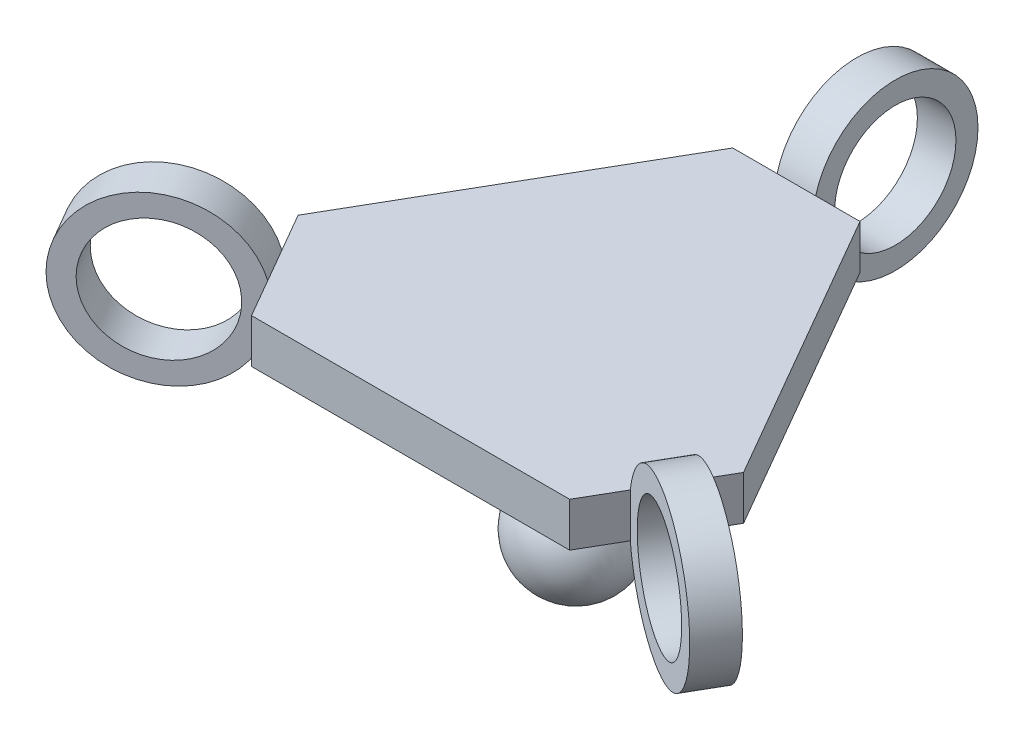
ISO-10303-21;
HEADER;
FILE_DESCRIPTION(('STEP AP214'),'2;1');
FILE_NAME('part.step','',(''),(''),'','','');
FILE_SCHEMA(('AUTOMOTIVE_DESIGN { 1 0 10303 214 1 1 1 1 }'));
ENDSEC;
DATA;
#1=APPLICATION_CONTEXT('core data for automotive mechanical design processes');
#2=APPLICATION_PROTOCOL_DEFINITION('international standard','automotive_design',2000,#1);
#3=PRODUCT_CONTEXT('',#1,'mechanical');
#4=PRODUCT('Part','Part','',(#3));
#5=PRODUCT_RELATED_PRODUCT_CATEGORY('part','',(#4));
#6=PRODUCT_DEFINITION_FORMATION('','',#4);
#7=PRODUCT_DEFINITION_CONTEXT('part definition',#1,'design');
#8=PRODUCT_DEFINITION('design','',#6,#7);
#9=PRODUCT_DEFINITION_SHAPE('','',#8);
#10=(LENGTH_UNIT() NAMED_UNIT(*) SI_UNIT(.MILLI.,.METRE.));
#11=(NAMED_UNIT(*) PLANE_ANGLE_UNIT() SI_UNIT($,.RADIAN.));
#12=(NAMED_UNIT(*) SI_UNIT($,.STERADIAN.) SOLID_ANGLE_UNIT());
#13=UNCERTAINTY_MEASURE_WITH_UNIT(LENGTH_MEASURE(1.E-05),#10,'distance_accuracy_value','');
#14=(GEOMETRIC_REPRESENTATION_CONTEXT(3) GLOBAL_UNCERTAINTY_ASSIGNED_CONTEXT((#13)) GLOBAL_UNIT_ASSIGNED_CONTEXT((#10,
#11,#12)) REPRESENTATION_CONTEXT('',''));
#15=CARTESIAN_POINT('',(0.,0.,0.));
#16=DIRECTION('',(0.,0.,1.));
#17=DIRECTION('',(1.,0.,0.));
#18=AXIS2_PLACEMENT_3D('',#15,#16,#17);
#19=CARTESIAN_POINT('',(0.,-26.,0.));
#20=DIRECTION('',(0.,0.,1.));
#21=DIRECTION('',(1.,0.,0.));
#22=AXIS2_PLACEMENT_3D('',#19,#20,#21);
#23=SPHERICAL_SURFACE('',#22,10.);
#24=CARTESIAN_POINT('',(0.,-26.,10.));
#25=VERTEX_POINT('',#24);
#26=VERTEX_LOOP('',#25);
#27=FACE_BOUND('',#26,.T.);
#28=ADVANCED_FACE('F44',(#27),#23,.T.);
#29=CLOSED_SHELL('',(#28));
#30=MANIFOLD_SOLID_BREP('B2',#29);
#31=CARTESIAN_POINT('',(0.,8.,0.));
#32=DIRECTION('',(0.,1.,0.));
#33=DIRECTION('',(0.,0.,1.));
#34=AXIS2_PLACEMENT_3D('',#31,#32,#33);
#35=PLANE('',#34);
#36=DIRECTION('',(-0.499999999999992,0.,0.866025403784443));
#37=VECTOR('',#36,1.);
#38=CARTESIAN_POINT('',(36.3877184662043,8.,16.9670071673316));
#39=LINE('',#38,#37);
#40=CARTESIAN_POINT('',(36.3877184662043,8.,16.9670071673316));
#41=VERTEX_POINT('',#40);
#42=CARTESIAN_POINT('',(32.8877184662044,8.,23.0291849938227));
#43=VERTEX_POINT('',#42);
#44=EDGE_CURVE('E76',#41,#43,#39,.T.);
#45=ORIENTED_EDGE('',*,*,#44,.F.);
#46=DIRECTION('',(0.866025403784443,0.,0.499999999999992));
#47=VECTOR('',#46,1.);
#48=CARTESIAN_POINT('',(1.74999999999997,8.,-3.03108891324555));
#49=LINE('',#48,#47);
#50=CARTESIAN_POINT('',(36.3910161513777,8.,16.9689110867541));
#51=VERTEX_POINT('',#50);
#52=EDGE_CURVE('E186',#41,#51,#49,.T.);
#53=ORIENTED_EDGE('',*,*,#52,.T.);
#54=DIRECTION('',(0.5,0.,-0.866025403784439));
#55=VECTOR('',#54,1.);
#56=CARTESIAN_POINT('',(28.8675134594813,8.,30.));
#57=LINE('',#56,#55);
#58=CARTESIAN_POINT('',(40.4145188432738,8.,9.99999999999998));
#59=VERTEX_POINT('',#58);
#60=EDGE_CURVE('E182',#51,#59,#57,.T.);
#61=ORIENTED_EDGE('',*,*,#60,.T.);
#62=DIRECTION('',(-0.5,0.,-0.866025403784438));
#63=VECTOR('',#62,1.);
#64=CARTESIAN_POINT('',(40.4145188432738,8.,9.99999999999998));
#65=LINE('',#64,#63);
#66=CARTESIAN_POINT('',(11.5470053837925,8.,-40.));
#67=VERTEX_POINT('',#66);
#68=EDGE_CURVE('E294',#59,#67,#65,.T.);
#69=ORIENTED_EDGE('',*,*,#68,.T.);
#70=DIRECTION('',(-1.,0.,0.));
#71=VECTOR('',#70,1.);
#72=CARTESIAN_POINT('',(11.5470053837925,8.,-40.));
#73=LINE('',#72,#71);
#74=CARTESIAN_POINT('',(3.5,8.,-40.));
#75=VERTEX_POINT('',#74);
#76=EDGE_CURVE('E299',#67,#75,#73,.T.);
#77=ORIENTED_EDGE('',*,*,#76,.T.);
#78=DIRECTION('',(0.,0.,-1.));
#79=VECTOR('',#78,1.);
#80=CARTESIAN_POINT('',(3.5,8.,0.));
#81=LINE('',#80,#79);
#82=CARTESIAN_POINT('',(3.5,8.,-39.9961921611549));
#83=VERTEX_POINT('',#82);
#84=EDGE_CURVE('E276',#83,#75,#81,.T.);
#85=ORIENTED_EDGE('',*,*,#84,.F.);
#86=DIRECTION('',(1.,0.,0.));
#87=VECTOR('',#86,1.);
#88=CARTESIAN_POINT('',(-3.5,8.,-39.9961921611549));
#89=LINE('',#88,#87);
#90=CARTESIAN_POINT('',(-3.5,8.,-39.9961921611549));
#91=VERTEX_POINT('',#90);
#92=EDGE_CURVE('E290',#91,#83,#89,.T.);
#93=ORIENTED_EDGE('',*,*,#92,.F.);
#94=DIRECTION('',(0.,0.,-1.));
#95=VECTOR('',#94,1.);
#96=CARTESIAN_POINT('',(-3.5,8.,0.));
#97=LINE('',#96,#95);
#98=CARTESIAN_POINT('',(-3.5,8.,-40.));
#99=VERTEX_POINT('',#98);
#100=EDGE_CURVE('E283',#91,#99,#97,.T.);
#101=ORIENTED_EDGE('',*,*,#100,.T.);
#102=CARTESIAN_POINT('',(-11.5470053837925,8.,-40.));
#103=VERTEX_POINT('',#102);
#104=EDGE_CURVE('E298',#99,#103,#73,.T.);
#105=ORIENTED_EDGE('',*,*,#104,.T.);
#106=DIRECTION('',(-0.5,0.,0.866025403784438));
#107=VECTOR('',#106,1.);
#108=CARTESIAN_POINT('',(-11.5470053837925,8.,-40.));
#109=LINE('',#108,#107);
#110=CARTESIAN_POINT('',(-40.4145188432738,8.,9.99999999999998));
#111=VERTEX_POINT('',#110);
#112=EDGE_CURVE('E303',#103,#111,#109,.T.);
#113=ORIENTED_EDGE('',*,*,#112,.T.);
#114=DIRECTION('',(0.5,0.,0.866025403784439));
#115=VECTOR('',#114,1.);
#116=CARTESIAN_POINT('',(-40.4145188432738,8.,9.99999999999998));
#117=LINE('',#116,#115);
#118=CARTESIAN_POINT('',(-36.3910161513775,8.,16.9689110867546));
#119=VERTEX_POINT('',#118);
#120=EDGE_CURVE('E307',#111,#119,#117,.T.);
#121=ORIENTED_EDGE('',*,*,#120,.T.);
#122=DIRECTION('',(-0.866025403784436,0.,0.500000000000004));
#123=VECTOR('',#122,1.);
#124=CARTESIAN_POINT('',(-1.75000000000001,8.,-3.03108891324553));
#125=LINE('',#124,#123);
#126=CARTESIAN_POINT('',(-36.3877184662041,8.,16.9670071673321));
#127=VERTEX_POINT('',#126);
#128=EDGE_CURVE('E230',#127,#119,#125,.T.);
#129=ORIENTED_EDGE('',*,*,#128,.F.);
#130=DIRECTION('',(-0.500000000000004,0.,-0.866025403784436));
#131=VECTOR('',#130,1.);
#132=CARTESIAN_POINT('',(-32.887718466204,8.,23.0291849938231));
#133=LINE('',#132,#131);
#134=CARTESIAN_POINT('',(-32.887718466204,8.,23.0291849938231));
#135=VERTEX_POINT('',#134);
#136=EDGE_CURVE('E244',#135,#127,#133,.T.);
#137=ORIENTED_EDGE('',*,*,#136,.F.);
#138=DIRECTION('',(-0.866025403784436,0.,0.500000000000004));
#139=VECTOR('',#138,1.);
#140=CARTESIAN_POINT('',(1.75000000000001,8.,3.03108891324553));
#141=LINE('',#140,#139);
#142=CARTESIAN_POINT('',(-32.8910161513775,8.,23.0310889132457));
#143=VERTEX_POINT('',#142);
#144=EDGE_CURVE('E237',#135,#143,#141,.T.);
#145=ORIENTED_EDGE('',*,*,#144,.T.);
#146=CARTESIAN_POINT('',(-28.8675134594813,8.,30.));
#147=VERTEX_POINT('',#146);
#148=EDGE_CURVE('E306',#143,#147,#117,.T.);
#149=ORIENTED_EDGE('',*,*,#148,.T.);
#150=DIRECTION('',(1.,0.,0.));
#151=VECTOR('',#150,1.);
#152=CARTESIAN_POINT('',(-28.8675134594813,8.,30.));
#153=LINE('',#152,#151);
#154=CARTESIAN_POINT('',(28.8675134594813,8.,30.));
#155=VERTEX_POINT('',#154);
#156=EDGE_CURVE('E311',#147,#155,#153,.T.);
#157=ORIENTED_EDGE('',*,*,#156,.T.);
#158=CARTESIAN_POINT('',(32.8910161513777,8.,23.0310889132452));
#159=VERTEX_POINT('',#158);
#160=EDGE_CURVE('E314',#155,#159,#57,.T.);
#161=ORIENTED_EDGE('',*,*,#160,.T.);
#162=DIRECTION('',(0.866025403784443,0.,0.499999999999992));
#163=VECTOR('',#162,1.);
#164=CARTESIAN_POINT('',(-1.74999999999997,8.,3.03108891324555));
#165=LINE('',#164,#163);
#166=EDGE_CURVE('E72',#43,#159,#165,.T.);
#167=ORIENTED_EDGE('',*,*,#166,.F.);
#168=EDGE_LOOP('',(#45,#53,#61,#69,#77,#85,#93,#101,#105,#113,#121,#129,#137,#145,#149,#157,
#161,#167));
#169=FACE_BOUND('',#168,.T.);
#170=ADVANCED_FACE('F56',(#169),#35,.T.);
#171=CARTESIAN_POINT('',(28.8675134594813,8.,30.));
#172=DIRECTION('',(-0.866025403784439,0.,-0.5));
#173=DIRECTION('',(-0.5,0.,0.866025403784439));
#174=AXIS2_PLACEMENT_3D('',#171,#172,#173);
#175=PLANE('',#174);
#176=DIRECTION('',(0.,1.,0.));
#177=VECTOR('',#176,1.);
#178=CARTESIAN_POINT('',(36.3910161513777,8.,16.9689110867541));
#179=LINE('',#178,#177);
#180=CARTESIAN_POINT('',(36.3910161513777,0.,16.9689110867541));
#181=VERTEX_POINT('',#180);
#182=EDGE_CURVE('E180',#181,#51,#179,.T.);
#183=ORIENTED_EDGE('',*,*,#182,.F.);
#184=DIRECTION('',(0.5,0.,-0.866025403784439));
#185=VECTOR('',#184,1.);
#186=CARTESIAN_POINT('',(28.8675134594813,0.,30.));
#187=LINE('',#186,#185);
#188=CARTESIAN_POINT('',(40.4145188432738,0.,9.99999999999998));
#189=VERTEX_POINT('',#188);
#190=EDGE_CURVE('E162',#181,#189,#187,.T.);
#191=ORIENTED_EDGE('',*,*,#190,.T.);
#192=DIRECTION('',(0.,-1.,0.));
#193=VECTOR('',#192,1.);
#194=CARTESIAN_POINT('',(40.4145188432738,8.,9.99999999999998));
#195=LINE('',#194,#193);
#196=EDGE_CURVE('E317',#59,#189,#195,.T.);
#197=ORIENTED_EDGE('',*,*,#196,.F.);
#198=ORIENTED_EDGE('',*,*,#60,.F.);
#199=EDGE_LOOP('',(#183,#191,#197,#198));
#200=FACE_BOUND('',#199,.T.);
#201=ADVANCED_FACE('F181',(#200),#175,.F.);
#202=CARTESIAN_POINT('',(-40.4145188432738,8.,9.99999999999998));
#203=DIRECTION('',(0.866025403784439,0.,-0.5));
#204=DIRECTION('',(-0.5,0.,-0.866025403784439));
#205=AXIS2_PLACEMENT_3D('',#202,#203,#204);
#206=PLANE('',#205);
#207=DIRECTION('',(0.,1.,0.));
#208=VECTOR('',#207,1.);
#209=CARTESIAN_POINT('',(-32.8910161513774,8.,23.0310889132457));
#210=LINE('',#209,#208);
#211=CARTESIAN_POINT('',(-32.8910161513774,0.,23.0310889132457));
#212=VERTEX_POINT('',#211);
#213=EDGE_CURVE('E240',#212,#143,#210,.T.);
#214=ORIENTED_EDGE('',*,*,#213,.F.);
#215=DIRECTION('',(0.5,0.,0.866025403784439));
#216=VECTOR('',#215,1.);
#217=CARTESIAN_POINT('',(-40.4145188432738,0.,9.99999999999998));
#218=LINE('',#217,#216);
#219=CARTESIAN_POINT('',(-28.8675134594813,0.,30.));
#220=VERTEX_POINT('',#219);
#221=EDGE_CURVE('E329',#212,#220,#218,.T.);
#222=ORIENTED_EDGE('',*,*,#221,.T.);
#223=DIRECTION('',(0.,-1.,0.));
#224=VECTOR('',#223,1.);
#225=CARTESIAN_POINT('',(-28.8675134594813,8.,30.));
#226=LINE('',#225,#224);
#227=EDGE_CURVE('E343',#147,#220,#226,.T.);
#228=ORIENTED_EDGE('',*,*,#227,.F.);
#229=ORIENTED_EDGE('',*,*,#148,.F.);
#230=EDGE_LOOP('',(#214,#222,#228,#229));
#231=FACE_BOUND('',#230,.T.);
#232=ADVANCED_FACE('F378',(#231),#206,.F.);
#233=CARTESIAN_POINT('',(11.5470053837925,8.,-40.));
#234=DIRECTION('',(0.,0.,1.));
#235=DIRECTION('',(1.,0.,0.));
#236=AXIS2_PLACEMENT_3D('',#233,#234,#235);
#237=PLANE('',#236);
#238=DIRECTION('',(0.,1.,0.));
#239=VECTOR('',#238,1.);
#240=CARTESIAN_POINT('',(-3.5,8.,-40.));
#241=LINE('',#240,#239);
#242=CARTESIAN_POINT('',(-3.5,0.,-40.));
#243=VERTEX_POINT('',#242);
#244=EDGE_CURVE('E286',#243,#99,#241,.T.);
#245=ORIENTED_EDGE('',*,*,#244,.F.);
#246=DIRECTION('',(-1.,0.,0.));
#247=VECTOR('',#246,1.);
#248=CARTESIAN_POINT('',(11.5470053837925,0.,-40.));
#249=LINE('',#248,#247);
#250=CARTESIAN_POINT('',(-11.5470053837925,0.,-40.));
#251=VERTEX_POINT('',#250);
#252=EDGE_CURVE('E320',#243,#251,#249,.T.);
#253=ORIENTED_EDGE('',*,*,#252,.T.);
#254=DIRECTION('',(0.,-1.,0.));
#255=VECTOR('',#254,1.);
#256=CARTESIAN_POINT('',(-11.5470053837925,8.,-40.));
#257=LINE('',#256,#255);
#258=EDGE_CURVE('E65',#103,#251,#257,.T.);
#259=ORIENTED_EDGE('',*,*,#258,.F.);
#260=ORIENTED_EDGE('',*,*,#104,.F.);
#261=EDGE_LOOP('',(#245,#253,#259,#260));
#262=FACE_BOUND('',#261,.T.);
#263=ADVANCED_FACE('F387',(#262),#237,.F.);
#264=CARTESIAN_POINT('',(40.4145188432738,8.,9.99999999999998));
#265=DIRECTION('',(-0.866025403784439,0.,0.5));
#266=DIRECTION('',(0.5,0.,0.866025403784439));
#267=AXIS2_PLACEMENT_3D('',#264,#265,#266);
#268=PLANE('',#267);
#269=DIRECTION('',(-0.5,0.,-0.866025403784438));
#270=VECTOR('',#269,1.);
#271=CARTESIAN_POINT('',(40.4145188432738,0.,9.99999999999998));
#272=LINE('',#271,#270);
#273=CARTESIAN_POINT('',(11.5470053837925,0.,-40.));
#274=VERTEX_POINT('',#273);
#275=EDGE_CURVE('E170',#189,#274,#272,.T.);
#276=ORIENTED_EDGE('',*,*,#275,.T.);
#277=DIRECTION('',(0.,-1.,0.));
#278=VECTOR('',#277,1.);
#279=CARTESIAN_POINT('',(11.5470053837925,8.,-40.));
#280=LINE('',#279,#278);
#281=EDGE_CURVE('E42',#67,#274,#280,.T.);
#282=ORIENTED_EDGE('',*,*,#281,.F.);
#283=ORIENTED_EDGE('',*,*,#68,.F.);
#284=ORIENTED_EDGE('',*,*,#196,.T.);
#285=EDGE_LOOP('',(#276,#282,#283,#284));
#286=FACE_BOUND('',#285,.T.);
#287=ADVANCED_FACE('F58',(#286),#268,.F.);
#288=CARTESIAN_POINT('',(3.5,0.,-40.));
#289=VERTEX_POINT('',#288);
#290=EDGE_CURVE('E321',#274,#289,#249,.T.);
#291=ORIENTED_EDGE('',*,*,#290,.T.);
#292=DIRECTION('',(0.,1.,0.));
#293=VECTOR('',#292,1.);
#294=CARTESIAN_POINT('',(3.5,8.,-40.));
#295=LINE('',#294,#293);
#296=EDGE_CURVE('E280',#289,#75,#295,.T.);
#297=ORIENTED_EDGE('',*,*,#296,.T.);
#298=ORIENTED_EDGE('',*,*,#76,.F.);
#299=ORIENTED_EDGE('',*,*,#281,.T.);
#300=EDGE_LOOP('',(#291,#297,#298,#299));
#301=FACE_BOUND('',#300,.T.);
#302=ADVANCED_FACE('F399',(#301),#237,.F.);
#303=CARTESIAN_POINT('',(-11.5470053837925,8.,-40.));
#304=DIRECTION('',(0.866025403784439,0.,0.5));
#305=DIRECTION('',(0.5,0.,-0.866025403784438));
#306=AXIS2_PLACEMENT_3D('',#303,#304,#305);
#307=PLANE('',#306);
#308=DIRECTION('',(-0.5,0.,0.866025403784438));
#309=VECTOR('',#308,1.);
#310=CARTESIAN_POINT('',(-11.5470053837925,0.,-40.));
#311=LINE('',#310,#309);
#312=CARTESIAN_POINT('',(-40.4145188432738,0.,9.99999999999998));
#313=VERTEX_POINT('',#312);
#314=EDGE_CURVE('E325',#251,#313,#311,.T.);
#315=ORIENTED_EDGE('',*,*,#314,.T.);
#316=DIRECTION('',(0.,-1.,0.));
#317=VECTOR('',#316,1.);
#318=CARTESIAN_POINT('',(-40.4145188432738,8.,9.99999999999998));
#319=LINE('',#318,#317);
#320=EDGE_CURVE('E347',#111,#313,#319,.T.);
#321=ORIENTED_EDGE('',*,*,#320,.F.);
#322=ORIENTED_EDGE('',*,*,#112,.F.);
#323=ORIENTED_EDGE('',*,*,#258,.T.);
#324=EDGE_LOOP('',(#315,#321,#322,#323));
#325=FACE_BOUND('',#324,.T.);
#326=ADVANCED_FACE('F356',(#325),#307,.F.);
#327=CARTESIAN_POINT('',(-36.3910161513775,0.,16.9689110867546));
#328=VERTEX_POINT('',#327);
#329=EDGE_CURVE('E330',#313,#328,#218,.T.);
#330=ORIENTED_EDGE('',*,*,#329,.T.);
#331=DIRECTION('',(0.,1.,0.));
#332=VECTOR('',#331,1.);
#333=CARTESIAN_POINT('',(-36.3910161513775,8.,16.9689110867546));
#334=LINE('',#333,#332);
#335=EDGE_CURVE('E234',#328,#119,#334,.T.);
#336=ORIENTED_EDGE('',*,*,#335,.T.);
#337=ORIENTED_EDGE('',*,*,#120,.F.);
#338=ORIENTED_EDGE('',*,*,#320,.T.);
#339=EDGE_LOOP('',(#330,#336,#337,#338));
#340=FACE_BOUND('',#339,.T.);
#341=ADVANCED_FACE('F364',(#340),#206,.F.);
#342=CARTESIAN_POINT('',(-28.8675134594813,8.,30.));
#343=DIRECTION('',(0.,0.,-1.));
#344=DIRECTION('',(-1.,0.,0.));
#345=AXIS2_PLACEMENT_3D('',#342,#343,#344);
#346=PLANE('',#345);
#347=DIRECTION('',(1.,0.,0.));
#348=VECTOR('',#347,1.);
#349=CARTESIAN_POINT('',(-28.8675134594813,0.,30.));
#350=LINE('',#349,#348);
#351=CARTESIAN_POINT('',(28.8675134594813,0.,30.));
#352=VERTEX_POINT('',#351);
#353=EDGE_CURVE('E176',#220,#352,#350,.T.);
#354=ORIENTED_EDGE('',*,*,#353,.T.);
#355=DIRECTION('',(0.,-1.,0.));
#356=VECTOR('',#355,1.);
#357=CARTESIAN_POINT('',(28.8675134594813,8.,30.));
#358=LINE('',#357,#356);
#359=EDGE_CURVE('E339',#155,#352,#358,.T.);
#360=ORIENTED_EDGE('',*,*,#359,.F.);
#361=ORIENTED_EDGE('',*,*,#156,.F.);
#362=ORIENTED_EDGE('',*,*,#227,.T.);
#363=EDGE_LOOP('',(#354,#360,#361,#362));
#364=FACE_BOUND('',#363,.T.);
#365=ADVANCED_FACE('F422',(#364),#346,.F.);
#366=CARTESIAN_POINT('',(32.8910161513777,0.,23.0310889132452));
#367=VERTEX_POINT('',#366);
#368=EDGE_CURVE('E175',#352,#367,#187,.T.);
#369=ORIENTED_EDGE('',*,*,#368,.T.);
#370=DIRECTION('',(0.,1.,0.));
#371=VECTOR('',#370,1.);
#372=CARTESIAN_POINT('',(32.8910161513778,8.,23.0310889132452));
#373=LINE('',#372,#371);
#374=EDGE_CURVE('E203',#367,#159,#373,.T.);
#375=ORIENTED_EDGE('',*,*,#374,.T.);
#376=ORIENTED_EDGE('',*,*,#160,.F.);
#377=ORIENTED_EDGE('',*,*,#359,.T.);
#378=EDGE_LOOP('',(#369,#375,#376,#377));
#379=FACE_BOUND('',#378,.T.);
#380=ADVANCED_FACE('F414',(#379),#175,.F.);
#381=CARTESIAN_POINT('',(0.,0.,0.));
#382=DIRECTION('',(0.,1.,0.));
#383=DIRECTION('',(0.,0.,1.));
#384=AXIS2_PLACEMENT_3D('',#381,#382,#383);
#385=PLANE('',#384);
#386=CARTESIAN_POINT('',(0.,0.,0.));
#387=DIRECTION('',(0.,1.,0.));
#388=DIRECTION('',(0.,0.,1.));
#389=AXIS2_PLACEMENT_3D('',#386,#387,#388);
#390=CIRCLE('',#389,5.);
#391=CARTESIAN_POINT('',(0.,0.,5.));
#392=VERTEX_POINT('',#391);
#393=EDGE_CURVE('E256',#392,#392,#390,.T.);
#394=ORIENTED_EDGE('',*,*,#393,.T.);
#395=EDGE_LOOP('',(#394));
#396=FACE_BOUND('',#395,.T.);
#397=ORIENTED_EDGE('',*,*,#275,.F.);
#398=ORIENTED_EDGE('',*,*,#190,.F.);
#399=DIRECTION('',(0.499999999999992,0.,-0.866025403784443));
#400=VECTOR('',#399,1.);
#401=CARTESIAN_POINT('',(28.8675134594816,0.,29.9999999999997));
#402=LINE('',#401,#400);
#403=EDGE_CURVE('E167',#367,#181,#402,.T.);
#404=ORIENTED_EDGE('',*,*,#403,.F.);
#405=ORIENTED_EDGE('',*,*,#368,.F.);
#406=ORIENTED_EDGE('',*,*,#353,.F.);
#407=ORIENTED_EDGE('',*,*,#221,.F.);
#408=DIRECTION('',(0.500000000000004,0.,0.866025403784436));
#409=VECTOR('',#408,1.);
#410=CARTESIAN_POINT('',(-40.4145188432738,0.,10.0000000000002));
#411=LINE('',#410,#409);
#412=EDGE_CURVE('E248',#328,#212,#411,.T.);
#413=ORIENTED_EDGE('',*,*,#412,.F.);
#414=ORIENTED_EDGE('',*,*,#329,.F.);
#415=ORIENTED_EDGE('',*,*,#314,.F.);
#416=ORIENTED_EDGE('',*,*,#252,.F.);
#417=EDGE_CURVE('E326',#289,#243,#249,.T.);
#418=ORIENTED_EDGE('',*,*,#417,.F.);
#419=ORIENTED_EDGE('',*,*,#290,.F.);
#420=EDGE_LOOP('',(#397,#398,#404,#405,#406,#407,#413,#414,#415,#416,#418,#419));
#421=FACE_BOUND('',#420,.T.);
#422=ADVANCED_FACE('F164',(#396,#421),#385,.F.);
#423=CARTESIAN_POINT('',(-3.5,4.00688116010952,-54.4549266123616));
#424=DIRECTION('',(1.,0.,0.));
#425=DIRECTION('',(0.,0.,-1.));
#426=AXIS2_PLACEMENT_3D('',#423,#424,#425);
#427=PLANE('',#426);
#428=CARTESIAN_POINT('',(-3.5,4.00688116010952,-54.4549266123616));
#429=DIRECTION('',(1.,0.,0.));
#430=DIRECTION('',(0.,0.,-1.));
#431=AXIS2_PLACEMENT_3D('',#428,#429,#430);
#432=CIRCLE('',#431,11.);
#433=CARTESIAN_POINT('',(-3.5,4.00688116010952,-65.4549266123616));
#434=VERTEX_POINT('',#433);
#435=EDGE_CURVE('E264',#434,#434,#432,.T.);
#436=ORIENTED_EDGE('',*,*,#435,.T.);
#437=EDGE_LOOP('',(#436));
#438=FACE_BOUND('',#437,.T.);
#439=CARTESIAN_POINT('',(-3.5,4.00688116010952,-54.4549266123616));
#440=DIRECTION('',(1.,0.,0.));
#441=DIRECTION('',(0.,0.,-1.));
#442=AXIS2_PLACEMENT_3D('',#439,#440,#441);
#443=CIRCLE('',#442,15.);
#444=EDGE_CURVE('E272',#243,#91,#443,.T.);
#445=ORIENTED_EDGE('',*,*,#444,.F.);
#446=ORIENTED_EDGE('',*,*,#244,.T.);
#447=ORIENTED_EDGE('',*,*,#100,.F.);
#448=EDGE_LOOP('',(#445,#446,#447));
#449=FACE_BOUND('',#448,.T.);
#450=ADVANCED_FACE('F394',(#438,#449),#427,.F.);
#451=CARTESIAN_POINT('',(3.5,4.00688116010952,-54.4549266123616));
#452=DIRECTION('',(1.,0.,0.));
#453=DIRECTION('',(0.,0.,-1.));
#454=AXIS2_PLACEMENT_3D('',#451,#452,#453);
#455=PLANE('',#454);
#456=CARTESIAN_POINT('',(3.5,4.00688116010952,-54.4549266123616));
#457=DIRECTION('',(1.,0.,0.));
#458=DIRECTION('',(0.,0.,-1.));
#459=AXIS2_PLACEMENT_3D('',#456,#457,#458);
#460=CIRCLE('',#459,11.);
#461=CARTESIAN_POINT('',(3.5,4.00688116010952,-65.4549266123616));
#462=VERTEX_POINT('',#461);
#463=EDGE_CURVE('E260',#462,#462,#460,.T.);
#464=ORIENTED_EDGE('',*,*,#463,.F.);
#465=EDGE_LOOP('',(#464));
#466=FACE_BOUND('',#465,.T.);
#467=ORIENTED_EDGE('',*,*,#296,.F.);
#468=CARTESIAN_POINT('',(3.5,4.00688116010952,-54.4549266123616));
#469=DIRECTION('',(1.,0.,0.));
#470=DIRECTION('',(0.,0.,-1.));
#471=AXIS2_PLACEMENT_3D('',#468,#469,#470);
#472=CIRCLE('',#471,15.);
#473=EDGE_CURVE('E268',#289,#83,#472,.T.);
#474=ORIENTED_EDGE('',*,*,#473,.T.);
#475=ORIENTED_EDGE('',*,*,#84,.T.);
#476=EDGE_LOOP('',(#467,#474,#475));
#477=FACE_BOUND('',#476,.T.);
#478=ADVANCED_FACE('F397',(#466,#477),#455,.T.);
#479=CARTESIAN_POINT('',(-3.5,4.00688116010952,-54.4549266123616));
#480=DIRECTION('',(1.,0.,0.));
#481=DIRECTION('',(0.,0.,-1.));
#482=AXIS2_PLACEMENT_3D('',#479,#480,#481);
#483=CYLINDRICAL_SURFACE('',#482,15.);
#484=ORIENTED_EDGE('',*,*,#444,.T.);
#485=ORIENTED_EDGE('',*,*,#92,.T.);
#486=ORIENTED_EDGE('',*,*,#473,.F.);
#487=ORIENTED_EDGE('',*,*,#417,.T.);
#488=EDGE_LOOP('',(#484,#485,#486,#487));
#489=FACE_BOUND('',#488,.T.);
#490=ADVANCED_FACE('F393',(#489),#483,.T.);
#491=CARTESIAN_POINT('',(-16.,4.00688116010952,-54.4549266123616));
#492=DIRECTION('',(1.,0.,0.));
#493=DIRECTION('',(0.,0.,-1.));
#494=AXIS2_PLACEMENT_3D('',#491,#492,#493);
#495=CYLINDRICAL_SURFACE('',#494,11.);
#496=ORIENTED_EDGE('',*,*,#463,.T.);
#497=EDGE_LOOP('',(#496));
#498=FACE_BOUND('',#497,.T.);
#499=ORIENTED_EDGE('',*,*,#435,.F.);
#500=EDGE_LOOP('',(#499));
#501=FACE_BOUND('',#500,.T.);
#502=ADVANCED_FACE('F473',(#498,#501),#495,.F.);
#503=CARTESIAN_POINT('',(0.,-26.,0.));
#504=DIRECTION('',(0.,1.,0.));
#505=DIRECTION('',(0.,0.,1.));
#506=AXIS2_PLACEMENT_3D('',#503,#504,#505);
#507=CYLINDRICAL_SURFACE('',#506,5.);
#508=CARTESIAN_POINT('',(0.,-26.,0.));
#509=DIRECTION('',(0.,1.,0.));
#510=DIRECTION('',(0.,0.,1.));
#511=AXIS2_PLACEMENT_3D('',#508,#509,#510);
#512=CIRCLE('',#511,5.);
#513=CARTESIAN_POINT('',(0.,-26.,5.));
#514=VERTEX_POINT('',#513);
#515=EDGE_CURVE('E252',#514,#514,#512,.T.);
#516=ORIENTED_EDGE('',*,*,#515,.T.);
#517=EDGE_LOOP('',(#516));
#518=FACE_BOUND('',#517,.T.);
#519=ORIENTED_EDGE('',*,*,#393,.F.);
#520=EDGE_LOOP('',(#519));
#521=FACE_BOUND('',#520,.T.);
#522=ADVANCED_FACE('F478',(#518,#521),#507,.T.);
#523=CARTESIAN_POINT('',(0.,-26.,0.));
#524=DIRECTION('',(0.,1.,0.));
#525=DIRECTION('',(0.,0.,1.));
#526=AXIS2_PLACEMENT_3D('',#523,#524,#525);
#527=PLANE('',#526);
#528=ORIENTED_EDGE('',*,*,#515,.F.);
#529=EDGE_LOOP('',(#528));
#530=FACE_BOUND('',#529,.T.);
#531=ADVANCED_FACE('F485',(#530),#527,.F.);
#532=CARTESIAN_POINT('',(-45.4093498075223,4.00688116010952,30.2585522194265));
#533=DIRECTION('',(-0.500000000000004,0.,-0.866025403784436));
#534=DIRECTION('',(-0.866025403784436,0.,0.500000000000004));
#535=AXIS2_PLACEMENT_3D('',#532,#533,#534);
#536=PLANE('',#535);
#537=CARTESIAN_POINT('',(-45.4093498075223,4.00688116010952,30.2585522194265));
#538=DIRECTION('',(-0.500000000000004,0.,-0.866025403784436));
#539=DIRECTION('',(-0.866025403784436,0.,0.500000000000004));
#540=AXIS2_PLACEMENT_3D('',#537,#538,#539);
#541=CIRCLE('',#540,11.);
#542=CARTESIAN_POINT('',(-54.9356292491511,4.00688116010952,35.7585522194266));
#543=VERTEX_POINT('',#542);
#544=EDGE_CURVE('E218',#543,#543,#541,.T.);
#545=ORIENTED_EDGE('',*,*,#544,.T.);
#546=EDGE_LOOP('',(#545));
#547=FACE_BOUND('',#546,.T.);
#548=CARTESIAN_POINT('',(-45.4093498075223,4.00688116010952,30.2585522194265));
#549=DIRECTION('',(-0.500000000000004,0.,-0.866025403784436));
#550=DIRECTION('',(-0.866025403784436,0.,0.500000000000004));
#551=AXIS2_PLACEMENT_3D('',#548,#549,#550);
#552=CIRCLE('',#551,15.);
#553=EDGE_CURVE('E226',#212,#135,#552,.T.);
#554=ORIENTED_EDGE('',*,*,#553,.F.);
#555=ORIENTED_EDGE('',*,*,#213,.T.);
#556=ORIENTED_EDGE('',*,*,#144,.F.);
#557=EDGE_LOOP('',(#554,#555,#556));
#558=FACE_BOUND('',#557,.T.);
#559=ADVANCED_FACE('F375',(#547,#558),#536,.F.);
#560=CARTESIAN_POINT('',(-48.9093498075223,4.00688116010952,24.1963743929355));
#561=DIRECTION('',(-0.500000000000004,0.,-0.866025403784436));
#562=DIRECTION('',(-0.866025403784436,0.,0.500000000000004));
#563=AXIS2_PLACEMENT_3D('',#560,#561,#562);
#564=PLANE('',#563);
#565=CARTESIAN_POINT('',(-48.9093498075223,4.00688116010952,24.1963743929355));
#566=DIRECTION('',(-0.500000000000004,0.,-0.866025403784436));
#567=DIRECTION('',(-0.866025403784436,0.,0.500000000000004));
#568=AXIS2_PLACEMENT_3D('',#565,#566,#567);
#569=CIRCLE('',#568,11.);
#570=CARTESIAN_POINT('',(-58.4356292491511,4.00688116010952,29.6963743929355));
#571=VERTEX_POINT('',#570);
#572=EDGE_CURVE('E196',#571,#571,#569,.T.);
#573=ORIENTED_EDGE('',*,*,#572,.F.);
#574=EDGE_LOOP('',(#573));
#575=FACE_BOUND('',#574,.T.);
#576=ORIENTED_EDGE('',*,*,#335,.F.);
#577=CARTESIAN_POINT('',(-48.9093498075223,4.00688116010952,24.1963743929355));
#578=DIRECTION('',(-0.500000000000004,0.,-0.866025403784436));
#579=DIRECTION('',(-0.866025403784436,0.,0.500000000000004));
#580=AXIS2_PLACEMENT_3D('',#577,#578,#579);
#581=CIRCLE('',#580,15.);
#582=EDGE_CURVE('E222',#328,#127,#581,.T.);
#583=ORIENTED_EDGE('',*,*,#582,.T.);
#584=ORIENTED_EDGE('',*,*,#128,.T.);
#585=EDGE_LOOP('',(#576,#583,#584));
#586=FACE_BOUND('',#585,.T.);
#587=ADVANCED_FACE('F368',(#575,#586),#564,.T.);
#588=CARTESIAN_POINT('',(-45.4093498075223,4.00688116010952,30.2585522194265));
#589=DIRECTION('',(-0.500000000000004,0.,-0.866025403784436));
#590=DIRECTION('',(-0.866025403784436,0.,0.500000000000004));
#591=AXIS2_PLACEMENT_3D('',#588,#589,#590);
#592=CYLINDRICAL_SURFACE('',#591,15.);
#593=ORIENTED_EDGE('',*,*,#553,.T.);
#594=ORIENTED_EDGE('',*,*,#136,.T.);
#595=ORIENTED_EDGE('',*,*,#582,.F.);
#596=ORIENTED_EDGE('',*,*,#412,.T.);
#597=EDGE_LOOP('',(#593,#594,#595,#596));
#598=FACE_BOUND('',#597,.T.);
#599=ADVANCED_FACE('F370',(#598),#592,.T.);
#600=CARTESIAN_POINT('',(-39.1593498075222,4.00688116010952,41.083869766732));
#601=DIRECTION('',(-0.500000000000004,0.,-0.866025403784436));
#602=DIRECTION('',(-0.866025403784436,0.,0.500000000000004));
#603=AXIS2_PLACEMENT_3D('',#600,#601,#602);
#604=CYLINDRICAL_SURFACE('',#603,11.);
#605=ORIENTED_EDGE('',*,*,#572,.T.);
#606=EDGE_LOOP('',(#605));
#607=FACE_BOUND('',#606,.T.);
#608=ORIENTED_EDGE('',*,*,#544,.F.);
#609=EDGE_LOOP('',(#608));
#610=FACE_BOUND('',#609,.T.);
#611=ADVANCED_FACE('F514',(#607,#610),#604,.F.);
#612=CARTESIAN_POINT('',(48.9093498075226,4.00688116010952,24.1963743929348));
#613=DIRECTION('',(-0.499999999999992,0.,0.866025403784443));
#614=DIRECTION('',(0.866025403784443,0.,0.499999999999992));
#615=AXIS2_PLACEMENT_3D('',#612,#613,#614);
#616=PLANE('',#615);
#617=CARTESIAN_POINT('',(48.9093498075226,4.00688116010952,24.1963743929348));
#618=DIRECTION('',(-0.499999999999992,0.,0.866025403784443));
#619=DIRECTION('',(0.866025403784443,0.,0.499999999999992));
#620=AXIS2_PLACEMENT_3D('',#617,#618,#619);
#621=CIRCLE('',#620,11.);
#622=CARTESIAN_POINT('',(58.4356292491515,4.00688116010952,29.6963743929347));
#623=VERTEX_POINT('',#622);
#624=EDGE_CURVE('E205',#623,#623,#621,.T.);
#625=ORIENTED_EDGE('',*,*,#624,.T.);
#626=EDGE_LOOP('',(#625));
#627=FACE_BOUND('',#626,.T.);
#628=CARTESIAN_POINT('',(48.9093498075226,4.00688116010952,24.1963743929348));
#629=DIRECTION('',(-0.499999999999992,0.,0.866025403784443));
#630=DIRECTION('',(0.866025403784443,0.,0.499999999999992));
#631=AXIS2_PLACEMENT_3D('',#628,#629,#630);
#632=CIRCLE('',#631,15.);
#633=EDGE_CURVE('E192',#181,#41,#632,.T.);
#634=ORIENTED_EDGE('',*,*,#633,.F.);
#635=ORIENTED_EDGE('',*,*,#182,.T.);
#636=ORIENTED_EDGE('',*,*,#52,.F.);
#637=EDGE_LOOP('',(#634,#635,#636));
#638=FACE_BOUND('',#637,.T.);
#639=ADVANCED_FACE('F198',(#627,#638),#616,.F.);
#640=CARTESIAN_POINT('',(45.4093498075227,4.00688116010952,30.2585522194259));
#641=DIRECTION('',(-0.499999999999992,0.,0.866025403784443));
#642=DIRECTION('',(0.866025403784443,0.,0.499999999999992));
#643=AXIS2_PLACEMENT_3D('',#640,#641,#642);
#644=PLANE('',#643);
#645=CARTESIAN_POINT('',(45.4093498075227,4.00688116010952,30.2585522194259));
#646=DIRECTION('',(-0.499999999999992,0.,0.866025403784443));
#647=DIRECTION('',(0.866025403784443,0.,0.499999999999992));
#648=AXIS2_PLACEMENT_3D('',#645,#646,#647);
#649=CIRCLE('',#648,11.);
#650=CARTESIAN_POINT('',(54.9356292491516,4.00688116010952,35.7585522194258));
#651=VERTEX_POINT('',#650);
#652=EDGE_CURVE('E626',#651,#651,#649,.T.);
#653=ORIENTED_EDGE('',*,*,#652,.F.);
#654=EDGE_LOOP('',(#653));
#655=FACE_BOUND('',#654,.T.);
#656=ORIENTED_EDGE('',*,*,#374,.F.);
#657=CARTESIAN_POINT('',(45.4093498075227,4.00688116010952,30.2585522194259));
#658=DIRECTION('',(-0.499999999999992,0.,0.866025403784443));
#659=DIRECTION('',(0.866025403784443,0.,0.499999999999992));
#660=AXIS2_PLACEMENT_3D('',#657,#658,#659);
#661=CIRCLE('',#660,15.);
#662=EDGE_CURVE('E194',#367,#43,#661,.T.);
#663=ORIENTED_EDGE('',*,*,#662,.T.);
#664=ORIENTED_EDGE('',*,*,#166,.T.);
#665=EDGE_LOOP('',(#656,#663,#664));
#666=FACE_BOUND('',#665,.T.);
#667=ADVANCED_FACE('F528',(#655,#666),#644,.T.);
#668=CARTESIAN_POINT('',(48.9093498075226,4.00688116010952,24.1963743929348));
#669=DIRECTION('',(-0.499999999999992,0.,0.866025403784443));
#670=DIRECTION('',(0.866025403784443,0.,0.499999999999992));
#671=AXIS2_PLACEMENT_3D('',#668,#669,#670);
#672=CYLINDRICAL_SURFACE('',#671,15.);
#673=ORIENTED_EDGE('',*,*,#633,.T.);
#674=ORIENTED_EDGE('',*,*,#44,.T.);
#675=ORIENTED_EDGE('',*,*,#662,.F.);
#676=ORIENTED_EDGE('',*,*,#403,.T.);
#677=EDGE_LOOP('',(#673,#674,#675,#676));
#678=FACE_BOUND('',#677,.T.);
#679=ADVANCED_FACE('F191',(#678),#672,.T.);
#680=CARTESIAN_POINT('',(55.1593498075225,4.00688116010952,13.3710568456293));
#681=DIRECTION('',(-0.499999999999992,0.,0.866025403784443));
#682=DIRECTION('',(0.866025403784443,0.,0.499999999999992));
#683=AXIS2_PLACEMENT_3D('',#680,#681,#682);
#684=CYLINDRICAL_SURFACE('',#683,11.);
#685=ORIENTED_EDGE('',*,*,#652,.T.);
#686=EDGE_LOOP('',(#685));
#687=FACE_BOUND('',#686,.T.);
#688=ORIENTED_EDGE('',*,*,#624,.F.);
#689=EDGE_LOOP('',(#688));
#690=FACE_BOUND('',#689,.T.);
#691=ADVANCED_FACE('F543',(#687,#690),#684,.F.);
#692=CLOSED_SHELL('',(#170,#201,#232,#263,#287,#302,#326,#341,#365,#380,#422,#450,#478,#490,
#502,#522,#531,#559,#587,#599,#611,#639,#667,#679,#691));
#693=MANIFOLD_SOLID_BREP('B6',#692);
#694=ADVANCED_BREP_SHAPE_REPRESENTATION('',(#18,#30,#693),#14);
#695=SHAPE_DEFINITION_REPRESENTATION(#9,#694);
ENDSEC;
END-ISO-10303-21;
